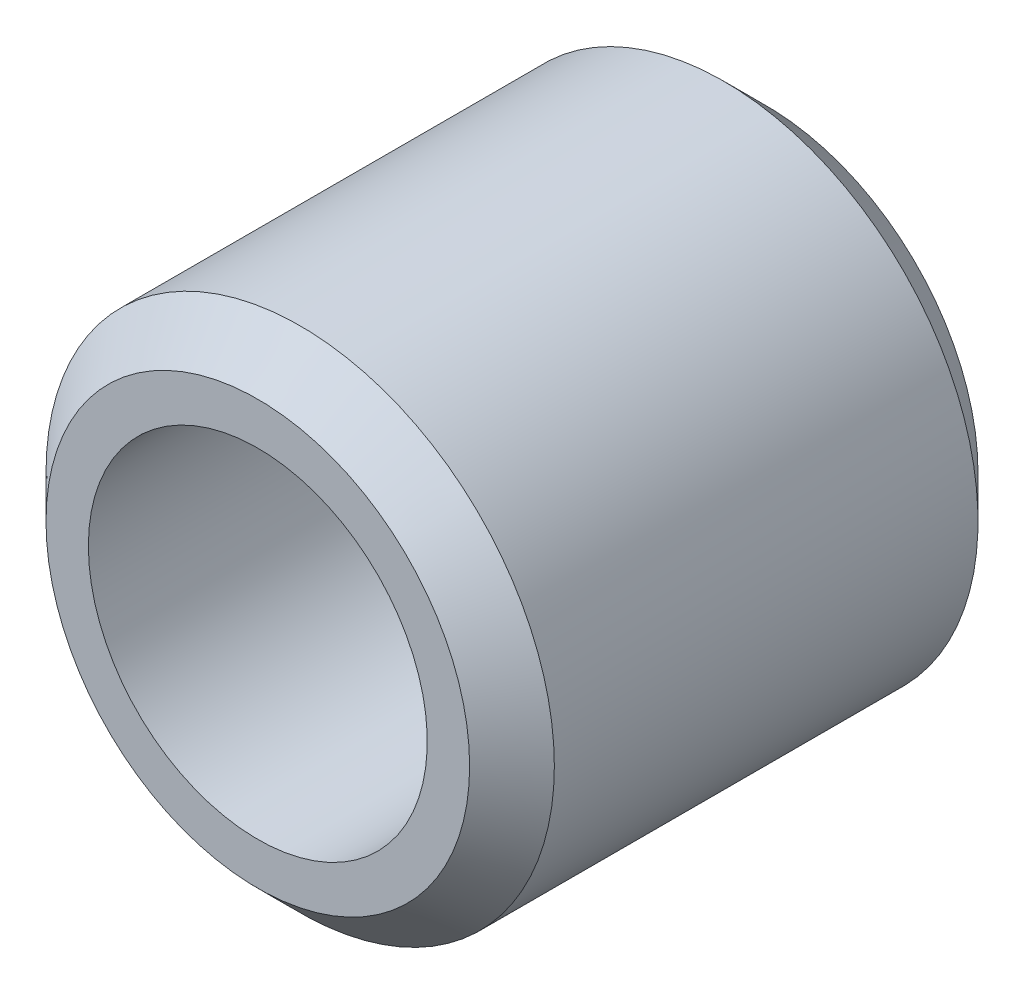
ISO-10303-21;
HEADER;
FILE_DESCRIPTION(('STEP AP214'),'2;1');
FILE_NAME('part.step','',(''),(''),'','','');
FILE_SCHEMA(('AUTOMOTIVE_DESIGN { 1 0 10303 214 1 1 1 1 }'));
ENDSEC;
DATA;
#1=APPLICATION_CONTEXT('core data for automotive mechanical design processes');
#2=APPLICATION_PROTOCOL_DEFINITION('international standard','automotive_design',2000,#1);
#3=PRODUCT_CONTEXT('',#1,'mechanical');
#4=PRODUCT('Part','Part','',(#3));
#5=PRODUCT_RELATED_PRODUCT_CATEGORY('part','',(#4));
#6=PRODUCT_DEFINITION_FORMATION('','',#4);
#7=PRODUCT_DEFINITION_CONTEXT('part definition',#1,'design');
#8=PRODUCT_DEFINITION('design','',#6,#7);
#9=PRODUCT_DEFINITION_SHAPE('','',#8);
#10=(LENGTH_UNIT() NAMED_UNIT(*) SI_UNIT(.MILLI.,.METRE.));
#11=(NAMED_UNIT(*) PLANE_ANGLE_UNIT() SI_UNIT($,.RADIAN.));
#12=(NAMED_UNIT(*) SI_UNIT($,.STERADIAN.) SOLID_ANGLE_UNIT());
#13=UNCERTAINTY_MEASURE_WITH_UNIT(LENGTH_MEASURE(1.E-05),#10,'distance_accuracy_value','');
#14=(GEOMETRIC_REPRESENTATION_CONTEXT(3) GLOBAL_UNCERTAINTY_ASSIGNED_CONTEXT((#13)) GLOBAL_UNIT_ASSIGNED_CONTEXT((#10,
#11,#12)) REPRESENTATION_CONTEXT('',''));
#15=CARTESIAN_POINT('',(0.,0.,0.));
#16=DIRECTION('',(0.,0.,1.));
#17=DIRECTION('',(1.,0.,0.));
#18=AXIS2_PLACEMENT_3D('',#15,#16,#17);
#19=CARTESIAN_POINT('',(0.,0.,0.));
#20=DIRECTION('',(0.,0.,-1.));
#21=DIRECTION('',(-1.,0.,0.));
#22=AXIS2_PLACEMENT_3D('',#19,#20,#21);
#23=CYLINDRICAL_SURFACE('',#22,4.);
#24=CARTESIAN_POINT('',(0.,0.,0.));
#25=DIRECTION('',(0.,0.,-1.));
#26=DIRECTION('',(-1.,0.,0.));
#27=AXIS2_PLACEMENT_3D('',#24,#25,#26);
#28=CIRCLE('',#27,4.);
#29=CARTESIAN_POINT('',(-4.,0.,0.));
#30=VERTEX_POINT('',#29);
#31=EDGE_CURVE('E34',#30,#30,#28,.T.);
#32=ORIENTED_EDGE('',*,*,#31,.T.);
#33=EDGE_LOOP('',(#32));
#34=FACE_BOUND('',#33,.T.);
#35=CARTESIAN_POINT('',(0.,0.,12.));
#36=DIRECTION('',(0.,0.,-1.));
#37=DIRECTION('',(-1.,0.,0.));
#38=AXIS2_PLACEMENT_3D('',#35,#36,#37);
#39=CIRCLE('',#38,4.);
#40=CARTESIAN_POINT('',(-4.,0.,12.));
#41=VERTEX_POINT('',#40);
#42=EDGE_CURVE('E31',#41,#41,#39,.T.);
#43=ORIENTED_EDGE('',*,*,#42,.F.);
#44=EDGE_LOOP('',(#43));
#45=FACE_BOUND('',#44,.T.);
#46=ADVANCED_FACE('F12',(#34,#45),#23,.F.);
#47=CARTESIAN_POINT('',(-4.,0.,12.));
#48=DIRECTION('',(0.,0.,1.));
#49=DIRECTION('',(1.,0.,0.));
#50=AXIS2_PLACEMENT_3D('',#47,#48,#49);
#51=PLANE('',#50);
#52=CARTESIAN_POINT('',(0.,0.,12.));
#53=DIRECTION('',(0.,0.,1.));
#54=DIRECTION('',(1.,0.,0.));
#55=AXIS2_PLACEMENT_3D('',#52,#53,#54);
#56=CIRCLE('',#55,5.);
#57=CARTESIAN_POINT('',(5.,0.,12.));
#58=VERTEX_POINT('',#57);
#59=EDGE_CURVE('E8',#58,#58,#56,.T.);
#60=ORIENTED_EDGE('',*,*,#59,.T.);
#61=EDGE_LOOP('',(#60));
#62=FACE_BOUND('',#61,.T.);
#63=ORIENTED_EDGE('',*,*,#42,.T.);
#64=EDGE_LOOP('',(#63));
#65=FACE_BOUND('',#64,.T.);
#66=ADVANCED_FACE('F55',(#62,#65),#51,.T.);
#67=CARTESIAN_POINT('',(0.,0.,0.));
#68=DIRECTION('',(0.,0.,-1.));
#69=DIRECTION('',(-1.,0.,0.));
#70=AXIS2_PLACEMENT_3D('',#67,#68,#69);
#71=CYLINDRICAL_SURFACE('',#70,6.);
#72=CARTESIAN_POINT('',(0.,0.,1.));
#73=DIRECTION('',(0.,0.,-1.));
#74=DIRECTION('',(-1.,0.,0.));
#75=AXIS2_PLACEMENT_3D('',#72,#73,#74);
#76=CIRCLE('',#75,6.);
#77=CARTESIAN_POINT('',(-6.,0.,1.));
#78=VERTEX_POINT('',#77);
#79=EDGE_CURVE('E18',#78,#78,#76,.F.);
#80=ORIENTED_EDGE('',*,*,#79,.T.);
#81=EDGE_LOOP('',(#80));
#82=FACE_BOUND('',#81,.T.);
#83=CARTESIAN_POINT('',(0.,0.,11.));
#84=DIRECTION('',(0.,0.,1.));
#85=DIRECTION('',(1.,0.,0.));
#86=AXIS2_PLACEMENT_3D('',#83,#84,#85);
#87=CIRCLE('',#86,6.);
#88=CARTESIAN_POINT('',(6.,0.,11.));
#89=VERTEX_POINT('',#88);
#90=EDGE_CURVE('E22',#89,#89,#87,.F.);
#91=ORIENTED_EDGE('',*,*,#90,.T.);
#92=EDGE_LOOP('',(#91));
#93=FACE_BOUND('',#92,.T.);
#94=ADVANCED_FACE('F43',(#82,#93),#71,.T.);
#95=CARTESIAN_POINT('',(-4.,0.,0.));
#96=DIRECTION('',(0.,0.,-1.));
#97=DIRECTION('',(-1.,0.,0.));
#98=AXIS2_PLACEMENT_3D('',#95,#96,#97);
#99=PLANE('',#98);
#100=CARTESIAN_POINT('',(0.,0.,0.));
#101=DIRECTION('',(0.,0.,-1.));
#102=DIRECTION('',(-1.,0.,0.));
#103=AXIS2_PLACEMENT_3D('',#100,#101,#102);
#104=CIRCLE('',#103,5.);
#105=CARTESIAN_POINT('',(-5.,0.,0.));
#106=VERTEX_POINT('',#105);
#107=EDGE_CURVE('E26',#106,#106,#104,.T.);
#108=ORIENTED_EDGE('',*,*,#107,.T.);
#109=EDGE_LOOP('',(#108));
#110=FACE_BOUND('',#109,.T.);
#111=ORIENTED_EDGE('',*,*,#31,.F.);
#112=EDGE_LOOP('',(#111));
#113=FACE_BOUND('',#112,.T.);
#114=ADVANCED_FACE('F40',(#110,#113),#99,.T.);
#115=CARTESIAN_POINT('',(0.,0.,0.));
#116=DIRECTION('',(0.,0.,1.));
#117=DIRECTION('',(1.,0.,0.));
#118=AXIS2_PLACEMENT_3D('',#115,#116,#117);
#119=CONICAL_SURFACE('',#118,5.,0.785398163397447);
#120=ORIENTED_EDGE('',*,*,#79,.F.);
#121=EDGE_LOOP('',(#120));
#122=FACE_BOUND('',#121,.T.);
#123=ORIENTED_EDGE('',*,*,#107,.F.);
#124=EDGE_LOOP('',(#123));
#125=FACE_BOUND('',#124,.T.);
#126=ADVANCED_FACE('F42',(#122,#125),#119,.T.);
#127=CARTESIAN_POINT('',(0.,0.,11.));
#128=DIRECTION('',(0.,0.,-1.));
#129=DIRECTION('',(-1.,0.,0.));
#130=AXIS2_PLACEMENT_3D('',#127,#128,#129);
#131=CONICAL_SURFACE('',#130,6.,0.78539816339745);
#132=ORIENTED_EDGE('',*,*,#59,.F.);
#133=EDGE_LOOP('',(#132));
#134=FACE_BOUND('',#133,.T.);
#135=ORIENTED_EDGE('',*,*,#90,.F.);
#136=EDGE_LOOP('',(#135));
#137=FACE_BOUND('',#136,.T.);
#138=ADVANCED_FACE('F52',(#134,#137),#131,.T.);
#139=CLOSED_SHELL('',(#46,#66,#94,#114,#126,#138));
#140=MANIFOLD_SOLID_BREP('B1',#139);
#141=ADVANCED_BREP_SHAPE_REPRESENTATION('',(#18,#140),#14);
#142=SHAPE_DEFINITION_REPRESENTATION(#9,#141);
ENDSEC;
END-ISO-10303-21;
